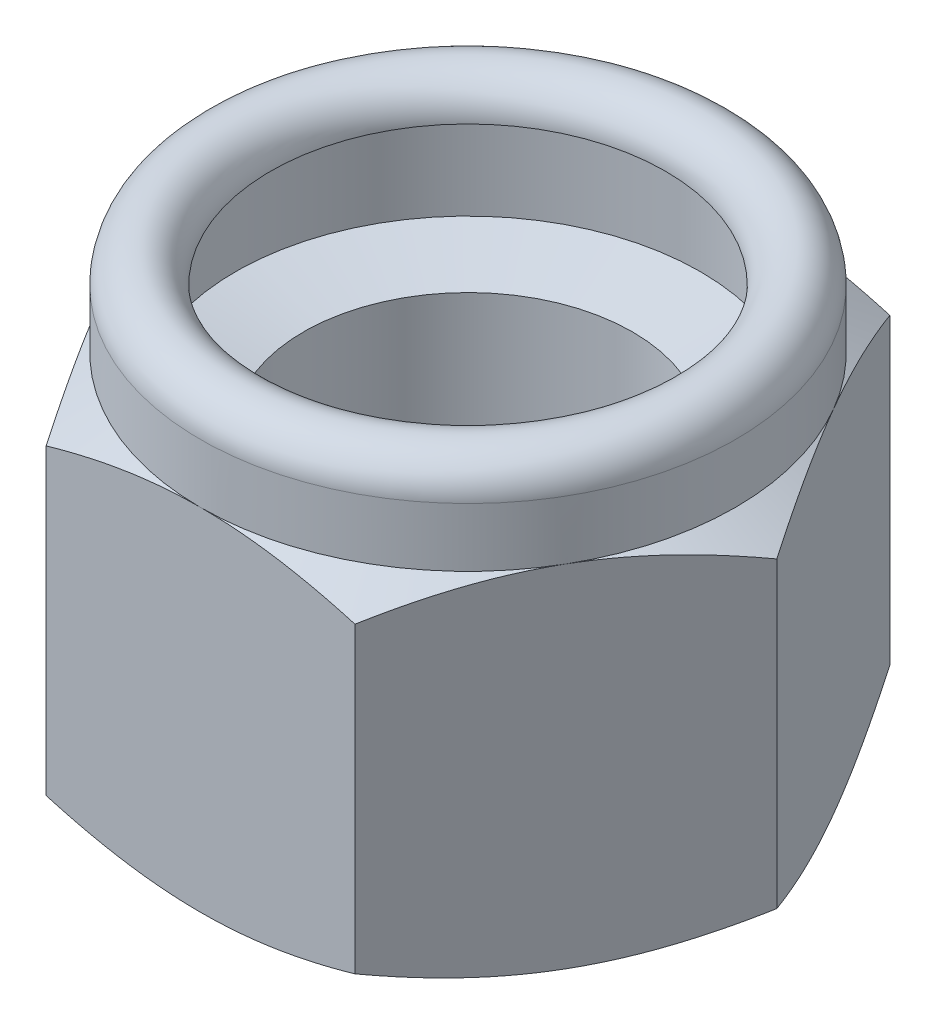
ISO-10303-21;
HEADER;
FILE_DESCRIPTION(('STEP AP214'),'2;1');
FILE_NAME('part.step','',(''),(''),'','','');
FILE_SCHEMA(('AUTOMOTIVE_DESIGN { 1 0 10303 214 1 1 1 1 }'));
ENDSEC;
DATA;
#1=APPLICATION_CONTEXT('core data for automotive mechanical design processes');
#2=APPLICATION_PROTOCOL_DEFINITION('international standard','automotive_design',2000,#1);
#3=PRODUCT_CONTEXT('',#1,'mechanical');
#4=PRODUCT('Part','Part','',(#3));
#5=PRODUCT_RELATED_PRODUCT_CATEGORY('part','',(#4));
#6=PRODUCT_DEFINITION_FORMATION('','',#4);
#7=PRODUCT_DEFINITION_CONTEXT('part definition',#1,'design');
#8=PRODUCT_DEFINITION('design','',#6,#7);
#9=PRODUCT_DEFINITION_SHAPE('','',#8);
#10=(LENGTH_UNIT() NAMED_UNIT(*) SI_UNIT(.MILLI.,.METRE.));
#11=(NAMED_UNIT(*) PLANE_ANGLE_UNIT() SI_UNIT($,.RADIAN.));
#12=(NAMED_UNIT(*) SI_UNIT($,.STERADIAN.) SOLID_ANGLE_UNIT());
#13=UNCERTAINTY_MEASURE_WITH_UNIT(LENGTH_MEASURE(1.E-05),#10,'distance_accuracy_value','');
#14=(GEOMETRIC_REPRESENTATION_CONTEXT(3) GLOBAL_UNCERTAINTY_ASSIGNED_CONTEXT((#13)) GLOBAL_UNIT_ASSIGNED_CONTEXT((#10,
#11,#12)) REPRESENTATION_CONTEXT('',''));
#15=CARTESIAN_POINT('',(0.,0.,0.));
#16=DIRECTION('',(0.,0.,1.));
#17=DIRECTION('',(1.,0.,0.));
#18=AXIS2_PLACEMENT_3D('',#15,#16,#17);
#19=CARTESIAN_POINT('',(0.,0.,0.));
#20=DIRECTION('',(0.,1.,0.));
#21=DIRECTION('',(0.,0.,1.));
#22=AXIS2_PLACEMENT_3D('',#19,#20,#21);
#23=CONICAL_SURFACE('',#22,6.5,1.04719754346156);
#24=CARTESIAN_POINT('',(7.50566896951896,0.580623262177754,0.000200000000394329));
#25=CARTESIAN_POINT('',(7.42317862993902,0.533004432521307,-0.142677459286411));
#26=CARTESIAN_POINT('',(7.34038072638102,0.487546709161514,-0.286087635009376));
#27=CARTESIAN_POINT('',(7.1741125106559,0.401548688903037,-0.57407263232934));
#28=CARTESIAN_POINT('',(7.09064192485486,0.361010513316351,-0.718647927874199));
#29=CARTESIAN_POINT('',(6.8388936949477,0.247571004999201,-1.15468865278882));
#30=CARTESIAN_POINT('',(6.6696223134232,0.183047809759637,-1.4478752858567));
#31=CARTESIAN_POINT('',(6.41631076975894,0.107386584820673,-1.88662374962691));
#32=CARTESIAN_POINT('',(6.33302747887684,0.0858328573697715,-2.03087464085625));
#33=CARTESIAN_POINT('',(6.16608458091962,0.0496903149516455,-2.32002822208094));
#34=CARTESIAN_POINT('',(6.08242500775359,0.0351008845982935,-2.46493085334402));
#35=CARTESIAN_POINT('',(5.91496056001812,0.0132587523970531,-2.75498778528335));
#36=CARTESIAN_POINT('',(5.83115595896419,0.0059977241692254,-2.90014161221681));
#37=CARTESIAN_POINT('',(5.66347396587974,-0.00103969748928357,-3.19057534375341));
#38=CARTESIAN_POINT('',(5.57959657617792,-0.000816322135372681,-3.33585524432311));
#39=CARTESIAN_POINT('',(5.34979921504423,0.0100834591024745,-3.73387594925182));
#40=CARTESIAN_POINT('',(5.20395446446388,0.0283818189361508,-3.98648646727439));
#41=CARTESIAN_POINT('',(4.91323365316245,0.0864063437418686,-4.49002968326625));
#42=CARTESIAN_POINT('',(4.76835861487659,0.126152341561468,-4.74096061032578));
#43=CARTESIAN_POINT('',(4.47705271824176,0.225505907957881,-5.2455172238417));
#44=CARTESIAN_POINT('',(4.33065861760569,0.285534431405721,-5.49907924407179));
#45=CARTESIAN_POINT('',(4.04005357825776,0.421775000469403,-6.00242193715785));
#46=CARTESIAN_POINT('',(3.89583891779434,0.497955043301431,-6.25220905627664));
#47=CARTESIAN_POINT('',(3.75266127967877,0.580623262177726,-6.50020000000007));
#48=B_SPLINE_CURVE_WITH_KNOTS('',3,(#24,#25,#26,#27,#28,#29,#30,#31,#32,#33,#34,#35,#36,#37,#38,
#39,#40,#41,#42,#43,#44,#45,#46,#47),.UNSPECIFIED.,.F.,.F.,(4,2,2,2,2,2,2,2,2,2,2,4),(0.,
0.515105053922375,1.03043143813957,2.06322555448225,2.5669739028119,3.07067773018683,
3.57380861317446,4.07692395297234,4.9527935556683,5.82947447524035,6.72559912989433,
7.61996451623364),.UNSPECIFIED.);
#49=CARTESIAN_POINT('',(7.50555349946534,0.580556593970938,0.));
#50=VERTEX_POINT('',#49);
#51=CARTESIAN_POINT('',(5.62916512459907,0.,-3.24999999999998));
#52=VERTEX_POINT('',#51);
#53=EDGE_CURVE('E235',#50,#52,#48,.T.);
#54=ORIENTED_EDGE('',*,*,#53,.F.);
#55=CARTESIAN_POINT('',(3.75266127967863,0.580623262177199,6.50019999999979));
#56=CARTESIAN_POINT('',(3.83515161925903,0.533004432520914,6.35732254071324));
#57=CARTESIAN_POINT('',(3.91794952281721,0.487546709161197,6.21391236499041));
#58=CARTESIAN_POINT('',(4.08421773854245,0.401548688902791,5.92592736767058));
#59=CARTESIAN_POINT('',(4.16768832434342,0.3610105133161,5.78135207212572));
#60=CARTESIAN_POINT('',(4.41943655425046,0.24757100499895,5.34531134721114));
#61=CARTESIAN_POINT('',(4.58870793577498,0.183047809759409,5.05212471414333));
#62=CARTESIAN_POINT('',(4.8420194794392,0.107386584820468,4.6133762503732));
#63=CARTESIAN_POINT('',(4.92530277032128,0.0858328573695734,4.46912535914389));
#64=CARTESIAN_POINT('',(5.09224566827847,0.0496903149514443,4.17997177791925));
#65=CARTESIAN_POINT('',(5.17590524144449,0.0351008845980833,4.03506914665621));
#66=CARTESIAN_POINT('',(5.34336968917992,0.0132587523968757,3.74501221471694));
#67=CARTESIAN_POINT('',(5.42717429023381,0.00599772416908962,3.59985838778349));
#68=CARTESIAN_POINT('',(5.59485628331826,-0.00103969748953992,3.30942465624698));
#69=CARTESIAN_POINT('',(5.67873367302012,-0.000816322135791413,3.16414475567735));
#70=CARTESIAN_POINT('',(5.90853103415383,0.0100834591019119,2.7661240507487));
#71=CARTESIAN_POINT('',(6.05437578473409,0.0283818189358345,2.51351353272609));
#72=CARTESIAN_POINT('',(6.34509659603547,0.0864063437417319,2.00997031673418));
#73=CARTESIAN_POINT('',(6.48997163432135,0.126152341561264,1.75903938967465));
#74=CARTESIAN_POINT('',(6.78127753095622,0.225505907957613,1.25448277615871));
#75=CARTESIAN_POINT('',(6.92767163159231,0.285534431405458,1.0009207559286));
#76=CARTESIAN_POINT('',(7.21827667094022,0.421775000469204,0.497578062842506));
#77=CARTESIAN_POINT('',(7.36249133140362,0.497955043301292,0.247790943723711));
#78=CARTESIAN_POINT('',(7.50566896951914,0.580623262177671,-0.000199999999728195));
#79=B_SPLINE_CURVE_WITH_KNOTS('',3,(#55,#56,#57,#58,#59,#60,#61,#62,#63,#64,#65,#66,#67,#68,#69,
#70,#71,#72,#73,#74,#75,#76,#77,#78),.UNSPECIFIED.,.F.,.F.,(4,2,2,2,2,2,2,2,2,2,2,4),(0.,
0.515105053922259,1.03043143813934,2.06322555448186,2.56697390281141,3.07067773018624,
3.57380861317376,4.07692395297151,4.95279355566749,5.82947447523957,6.72559912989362,
7.61996451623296),.UNSPECIFIED.);
#80=CARTESIAN_POINT('',(5.62916512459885,-1.38777878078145E-13,3.24999999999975));
#81=VERTEX_POINT('',#80);
#82=EDGE_CURVE('E148',#81,#50,#79,.T.);
#83=ORIENTED_EDGE('',*,*,#82,.F.);
#84=CARTESIAN_POINT('',(0.,0.,0.));
#85=DIRECTION('',(0.,-1.,0.));
#86=DIRECTION('',(0.,0.,-1.));
#87=AXIS2_PLACEMENT_3D('',#84,#85,#86);
#88=CIRCLE('',#87,6.5);
#89=EDGE_CURVE('E257',#52,#81,#88,.T.);
#90=ORIENTED_EDGE('',*,*,#89,.F.);
#91=EDGE_LOOP('',(#54,#83,#90));
#92=FACE_BOUND('',#91,.T.);
#93=ADVANCED_FACE('F30',(#92),#23,.T.);
#94=CARTESIAN_POINT('',(3.75277674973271,0.580556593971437,-6.50000000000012));
#95=VERTEX_POINT('',#94);
#96=EDGE_CURVE('E230',#52,#95,#48,.T.);
#97=ORIENTED_EDGE('',*,*,#96,.F.);
#98=CARTESIAN_POINT('',(2.77555756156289E-13,0.,-6.50000000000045));
#99=VERTEX_POINT('',#98);
#100=EDGE_CURVE('E255',#99,#52,#88,.T.);
#101=ORIENTED_EDGE('',*,*,#100,.F.);
#102=CARTESIAN_POINT('',(-10.0886341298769,3.17616114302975,-6.50000000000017));
#103=CARTESIAN_POINT('',(-9.80467347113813,3.03838174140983,-6.5000000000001));
#104=CARTESIAN_POINT('',(-9.52006185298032,2.90192102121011,-6.50000000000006));
#105=CARTESIAN_POINT('',(-8.94919057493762,2.63237840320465,-6.50000000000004));
#106=CARTESIAN_POINT('',(-8.66293066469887,2.49929703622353,-6.50000000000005));
#107=CARTESIAN_POINT('',(-8.08694567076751,2.23658679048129,-6.50000000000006));
#108=CARTESIAN_POINT('',(-7.79721021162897,2.10698058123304,-6.50000000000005));
#109=CARTESIAN_POINT('',(-7.21543776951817,1.85306089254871,-6.50000000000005));
#110=CARTESIAN_POINT('',(-6.92340089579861,1.72874716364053,-6.50000000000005));
#111=CARTESIAN_POINT('',(-6.32709030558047,1.48290474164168,-6.50000000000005));
#112=CARTESIAN_POINT('',(-6.02272573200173,1.36159523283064,-6.50000000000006));
#113=CARTESIAN_POINT('',(-5.41043841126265,1.1281375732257,-6.50000000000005));
#114=CARTESIAN_POINT('',(-5.10251526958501,1.01599044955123,-6.50000000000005));
#115=CARTESIAN_POINT('',(-4.48319586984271,0.803795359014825,-6.50000000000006));
#116=CARTESIAN_POINT('',(-4.17180806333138,0.70372296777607,-6.50000000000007));
#117=CARTESIAN_POINT('',(-3.54456226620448,0.518884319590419,-6.50000000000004));
#118=CARTESIAN_POINT('',(-3.2287057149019,0.434113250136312,-6.50000000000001));
#119=CARTESIAN_POINT('',(-2.59412088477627,0.284389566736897,-6.50000000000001));
#120=CARTESIAN_POINT('',(-2.27541854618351,0.219328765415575,-6.50000000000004));
#121=CARTESIAN_POINT('',(-1.63399658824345,0.112709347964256,-6.50000000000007));
#122=CARTESIAN_POINT('',(-1.31127735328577,0.0711485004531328,-6.50000000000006));
#123=CARTESIAN_POINT('',(-0.827615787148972,0.0291913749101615,-6.50000000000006));
#124=CARTESIAN_POINT('',(-0.667517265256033,0.0186073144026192,-6.50000000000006));
#125=CARTESIAN_POINT('',(-0.347008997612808,0.00421359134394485,-6.50000000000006));
#126=CARTESIAN_POINT('',(-0.186599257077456,0.000403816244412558,-6.50000000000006));
#127=CARTESIAN_POINT('',(0.134235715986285,-0.000342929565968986,-6.50000000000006));
#128=CARTESIAN_POINT('',(0.294660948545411,0.00272011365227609,-6.50000000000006));
#129=CARTESIAN_POINT('',(0.615239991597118,0.0156420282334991,-6.50000000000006));
#130=CARTESIAN_POINT('',(0.775393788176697,0.0255012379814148,-6.50000000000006));
#131=CARTESIAN_POINT('',(1.16005135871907,0.0571346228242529,-6.50000000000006));
#132=CARTESIAN_POINT('',(1.384296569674,0.0821202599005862,-6.50000000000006));
#133=CARTESIAN_POINT('',(1.83111748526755,0.144054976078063,-6.50000000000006));
#134=CARTESIAN_POINT('',(2.0536929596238,0.181005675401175,-6.50000000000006));
#135=CARTESIAN_POINT('',(2.71866392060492,0.307845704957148,-6.50000000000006));
#136=CARTESIAN_POINT('',(3.15805420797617,0.413699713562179,-6.50000000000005));
#137=CARTESIAN_POINT('',(3.81504917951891,0.597194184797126,-6.50000000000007));
#138=CARTESIAN_POINT('',(4.03606361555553,0.663327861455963,-6.50000000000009));
#139=CARTESIAN_POINT('',(4.47594587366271,0.802449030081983,-6.50000000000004));
#140=CARTESIAN_POINT('',(4.69481368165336,0.875436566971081,-6.49999999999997));
#141=CARTESIAN_POINT('',(5.13047157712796,1.0270956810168,-6.50000000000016));
#142=CARTESIAN_POINT('',(5.34726232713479,1.10576537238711,-6.50000000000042));
#143=CARTESIAN_POINT('',(5.77904891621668,1.26786470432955,-6.49999999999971));
#144=CARTESIAN_POINT('',(5.99404477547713,1.35129429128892,-6.49999999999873));
#145=CARTESIAN_POINT('',(6.49787787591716,1.55220480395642,-6.49999999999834));
#146=CARTESIAN_POINT('',(6.78605773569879,1.6713311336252,-6.4999999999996));
#147=CARTESIAN_POINT('',(7.35998859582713,1.91531429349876,-6.50000000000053));
#148=CARTESIAN_POINT('',(7.64573945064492,2.040171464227,-6.50000000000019));
#149=CARTESIAN_POINT('',(8.21525357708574,2.29447640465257,-6.49999999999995));
#150=CARTESIAN_POINT('',(8.49901644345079,2.42392507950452,-6.50000000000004));
#151=CARTESIAN_POINT('',(9.06483728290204,2.68650288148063,-6.5000000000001));
#152=CARTESIAN_POINT('',(9.34689521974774,2.81963208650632,-6.50000000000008));
#153=CARTESIAN_POINT('',(9.90987348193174,3.08902515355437,-6.50000000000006));
#154=CARTESIAN_POINT('',(10.1907922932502,3.22529217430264,-6.50000000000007));
#155=CARTESIAN_POINT('',(10.7514192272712,3.50029662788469,-6.50000000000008));
#156=CARTESIAN_POINT('',(11.0311273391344,3.63903408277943,-6.50000000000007));
#157=CARTESIAN_POINT('',(11.8686492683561,4.05826371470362,-6.50000000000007));
#158=CARTESIAN_POINT('',(12.4249347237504,4.3418088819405,-6.50000000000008));
#159=CARTESIAN_POINT('',(13.4885089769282,4.89087824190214,-6.50000000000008));
#160=CARTESIAN_POINT('',(13.9960343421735,5.15594623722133,-6.50000000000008));
#161=CARTESIAN_POINT('',(15.0091848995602,5.6897287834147,-6.50000000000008));
#162=CARTESIAN_POINT('',(15.5148100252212,5.95844346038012,-6.50000000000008));
#163=CARTESIAN_POINT('',(16.5233283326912,6.49798637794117,-6.50000000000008));
#164=CARTESIAN_POINT('',(17.0262251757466,6.76880778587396,-6.50000000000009));
#165=CARTESIAN_POINT('',(18.0308016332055,7.31263450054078,-6.50000000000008));
#166=CARTESIAN_POINT('',(18.5324813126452,7.5856396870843,-6.50000000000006));
#167=CARTESIAN_POINT('',(19.0337120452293,7.85946110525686,-6.50000000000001));
#168=B_SPLINE_CURVE_WITH_KNOTS('',3,(#102,#103,#104,#105,#106,#107,#108,#109,#110,#111,#112,
#113,#114,#115,#116,#117,#118,#119,#120,#121,#122,#123,#124,#125,#126,#127,#128,#129,#130,#131,
#132,#133,#134,#135,#136,#137,#138,#139,#140,#141,#142,#143,#144,#145,#146,#147,#148,#149,#150,
#151,#152,#153,#154,#155,#156,#157,#158,#159,#160,#161,#162,#163,#164,#165,#166,#167),
.UNSPECIFIED.,.F.,.F.,(4,2,2,2,2,2,2,2,2,2,2,2,2,2,2,2,2,2,2,2,2,2,2,2,2,2,2,2,2,2,2,2,4),(0.,
0.946875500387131,1.8938988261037,2.84606421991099,3.79818468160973,4.78101744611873,
5.76396023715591,6.74488019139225,7.72549109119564,8.70061771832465,9.67565173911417,
10.1568741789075,10.6380886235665,11.1193040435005,11.6005434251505,12.2770600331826,
12.9536682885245,14.3076338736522,14.9996668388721,15.6917043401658,16.3835132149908,
17.0753142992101,18.0107248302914,18.9461910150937,19.8818426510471,20.8175141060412,
21.7541726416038,22.6908395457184,24.5639267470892,26.2816383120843,27.9994094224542,
29.7129512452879,31.4263993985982),.UNSPECIFIED.);
#169=EDGE_CURVE('E291',#95,#99,#168,.F.);
#170=ORIENTED_EDGE('',*,*,#169,.F.);
#171=EDGE_LOOP('',(#97,#101,#170));
#172=FACE_BOUND('',#171,.T.);
#173=ADVANCED_FACE('F274',(#172),#23,.T.);
#174=CARTESIAN_POINT('',(-3.75277674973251,0.580556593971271,-6.49999999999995));
#175=VERTEX_POINT('',#174);
#176=EDGE_CURVE('E205',#99,#175,#168,.F.);
#177=ORIENTED_EDGE('',*,*,#176,.F.);
#178=CARTESIAN_POINT('',(-5.62916512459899,-4.44089209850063E-13,-3.25000000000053));
#179=VERTEX_POINT('',#178);
#180=EDGE_CURVE('E253',#179,#99,#88,.T.);
#181=ORIENTED_EDGE('',*,*,#180,.F.);
#182=CARTESIAN_POINT('',(-3.75266127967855,0.580623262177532,-6.50020000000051));
#183=CARTESIAN_POINT('',(-3.83515161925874,0.533004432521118,-6.35732254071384));
#184=CARTESIAN_POINT('',(-3.91794952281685,0.487546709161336,-6.21391236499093));
#185=CARTESIAN_POINT('',(-4.08421773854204,0.40154868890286,-5.925927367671));
#186=CARTESIAN_POINT('',(-4.16768832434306,0.361010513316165,-5.78135207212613));
#187=CARTESIAN_POINT('',(-4.41943655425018,0.247571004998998,-5.34531134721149));
#188=CARTESIAN_POINT('',(-4.58870793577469,0.183047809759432,-5.05212471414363));
#189=CARTESIAN_POINT('',(-4.84201947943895,0.107386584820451,-4.61337625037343));
#190=CARTESIAN_POINT('',(-4.92530277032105,0.0858328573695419,-4.4691253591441));
#191=CARTESIAN_POINT('',(-5.09224566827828,0.0496903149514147,-4.1799717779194));
#192=CARTESIAN_POINT('',(-5.17590524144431,0.0351008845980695,-4.03506914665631));
#193=CARTESIAN_POINT('',(-5.34336968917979,0.0132587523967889,-3.74501221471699));
#194=CARTESIAN_POINT('',(-5.42717429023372,0.00599772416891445,-3.59985838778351));
#195=CARTESIAN_POINT('',(-5.59485628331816,-0.00103969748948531,-3.3094246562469));
#196=CARTESIAN_POINT('',(-5.67873367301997,-0.000816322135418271,-3.16414475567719));
#197=CARTESIAN_POINT('',(-5.90853103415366,0.0100834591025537,-2.76612405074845));
#198=CARTESIAN_POINT('',(-6.05437578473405,0.0283818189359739,-2.51351353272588));
#199=CARTESIAN_POINT('',(-6.34509659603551,0.0864063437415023,-2.009970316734));
#200=CARTESIAN_POINT('',(-6.48997163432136,0.126152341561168,-1.75903938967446));
#201=CARTESIAN_POINT('',(-6.78127753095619,0.225505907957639,-1.25448277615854));
#202=CARTESIAN_POINT('',(-6.92767163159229,0.285534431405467,-1.00092075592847));
#203=CARTESIAN_POINT('',(-7.21827667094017,0.421775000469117,-0.497578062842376));
#204=CARTESIAN_POINT('',(-7.36249133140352,0.497955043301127,-0.247790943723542));
#205=CARTESIAN_POINT('',(-7.5056689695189,0.580623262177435,0.000200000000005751));
#206=B_SPLINE_CURVE_WITH_KNOTS('',3,(#182,#183,#184,#185,#186,#187,#188,#189,#190,#191,#192,
#193,#194,#195,#196,#197,#198,#199,#200,#201,#202,#203,#204,#205),.UNSPECIFIED.,.F.,.F.,(4,2,2,
2,2,2,2,2,2,2,2,4),(0.,0.515105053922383,1.03043143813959,2.06322555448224,2.56697390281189,
3.07067773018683,3.57380861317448,4.07692395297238,4.95279355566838,5.82947447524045,
6.72559912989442,7.61996451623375),.UNSPECIFIED.);
#207=EDGE_CURVE('E200',#175,#179,#206,.T.);
#208=ORIENTED_EDGE('',*,*,#207,.F.);
#209=EDGE_LOOP('',(#177,#181,#208));
#210=FACE_BOUND('',#209,.T.);
#211=ADVANCED_FACE('F279',(#210),#23,.T.);
#212=CARTESIAN_POINT('',(-7.50555349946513,0.580556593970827,-1.11022302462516E-13));
#213=VERTEX_POINT('',#212);
#214=EDGE_CURVE('E201',#179,#213,#206,.T.);
#215=ORIENTED_EDGE('',*,*,#214,.F.);
#216=CARTESIAN_POINT('',(-5.62916512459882,2.63677968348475E-13,3.25000000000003));
#217=VERTEX_POINT('',#216);
#218=EDGE_CURVE('E341',#217,#179,#88,.T.);
#219=ORIENTED_EDGE('',*,*,#218,.F.);
#220=CARTESIAN_POINT('',(-7.50566896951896,0.580623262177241,-0.000199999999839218));
#221=CARTESIAN_POINT('',(-7.42317862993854,0.533004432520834,0.142677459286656));
#222=CARTESIAN_POINT('',(-7.34038072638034,0.487546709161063,0.286087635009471));
#223=CARTESIAN_POINT('',(-7.17411251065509,0.401548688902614,0.574072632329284));
#224=CARTESIAN_POINT('',(-7.09064192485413,0.361010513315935,0.718647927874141));
#225=CARTESIAN_POINT('',(-6.83889369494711,0.247571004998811,1.15468865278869));
#226=CARTESIAN_POINT('',(-6.66962231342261,0.18304780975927,1.44787528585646));
#227=CARTESIAN_POINT('',(-6.41631076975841,0.107386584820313,1.88662374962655));
#228=CARTESIAN_POINT('',(-6.33302747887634,0.085832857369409,2.03087464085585));
#229=CARTESIAN_POINT('',(-6.16608458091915,0.0496903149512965,2.32002822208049));
#230=CARTESIAN_POINT('',(-6.08242500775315,0.0351008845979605,2.46493085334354));
#231=CARTESIAN_POINT('',(-5.9149605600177,0.0132587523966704,2.75498778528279));
#232=CARTESIAN_POINT('',(-5.83115595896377,0.00599772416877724,2.90014161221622));
#233=CARTESIAN_POINT('',(-5.6634739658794,-0.00103969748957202,3.1905753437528));
#234=CARTESIAN_POINT('',(-5.57959657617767,-0.000816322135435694,3.3358552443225));
#235=CARTESIAN_POINT('',(-5.34979921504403,0.010083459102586,3.73387594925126));
#236=CARTESIAN_POINT('',(-5.20395446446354,0.0283818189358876,3.9864864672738));
#237=CARTESIAN_POINT('',(-4.913233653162,0.0864063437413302,4.49002968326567));
#238=CARTESIAN_POINT('',(-4.76835861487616,0.126152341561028,4.74096061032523));
#239=CARTESIAN_POINT('',(-4.47705271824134,0.225505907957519,5.24551722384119));
#240=CARTESIAN_POINT('',(-4.33065861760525,0.285534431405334,5.49907924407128));
#241=CARTESIAN_POINT('',(-4.04005357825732,0.421775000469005,6.00242193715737));
#242=CARTESIAN_POINT('',(-3.89583891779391,0.49795504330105,6.25220905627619));
#243=CARTESIAN_POINT('',(-3.75266127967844,0.580623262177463,6.50019999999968));
#244=B_SPLINE_CURVE_WITH_KNOTS('',3,(#220,#221,#222,#223,#224,#225,#226,#227,#228,#229,#230,
#231,#232,#233,#234,#235,#236,#237,#238,#239,#240,#241,#242,#243),.UNSPECIFIED.,.F.,.F.,(4,2,2,
2,2,2,2,2,2,2,2,4),(0.,0.515105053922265,1.03043143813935,2.06322555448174,2.56697390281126,
3.07067773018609,3.57380861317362,4.07692395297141,4.95279355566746,5.82947447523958,
6.72559912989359,7.61996451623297),.UNSPECIFIED.);
#245=EDGE_CURVE('E348',#213,#217,#244,.T.);
#246=ORIENTED_EDGE('',*,*,#245,.F.);
#247=EDGE_LOOP('',(#215,#219,#246));
#248=FACE_BOUND('',#247,.T.);
#249=ADVANCED_FACE('F464',(#248),#23,.T.);
#250=CARTESIAN_POINT('',(-3.75277674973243,0.580556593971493,6.50000000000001));
#251=VERTEX_POINT('',#250);
#252=EDGE_CURVE('E328',#217,#251,#244,.T.);
#253=ORIENTED_EDGE('',*,*,#252,.F.);
#254=CARTESIAN_POINT('',(3.05311331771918E-13,3.60822483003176E-13,6.49999999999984));
#255=VERTEX_POINT('',#254);
#256=EDGE_CURVE('E338',#255,#217,#88,.T.);
#257=ORIENTED_EDGE('',*,*,#256,.F.);
#258=CARTESIAN_POINT('',(-10.088634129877,3.17616114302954,6.49999999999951));
#259=CARTESIAN_POINT('',(-9.80467347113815,3.0383817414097,6.49999999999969));
#260=CARTESIAN_POINT('',(-9.52006185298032,2.90192102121,6.49999999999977));
#261=CARTESIAN_POINT('',(-8.94919057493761,2.63237840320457,6.49999999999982));
#262=CARTESIAN_POINT('',(-8.66293066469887,2.49929703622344,6.4999999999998));
#263=CARTESIAN_POINT('',(-8.08694567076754,2.2365867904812,6.49999999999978));
#264=CARTESIAN_POINT('',(-7.79721021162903,2.10698058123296,6.49999999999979));
#265=CARTESIAN_POINT('',(-7.21543776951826,1.85306089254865,6.49999999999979));
#266=CARTESIAN_POINT('',(-6.92340089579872,1.72874716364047,6.49999999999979));
#267=CARTESIAN_POINT('',(-6.3270903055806,1.48290474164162,6.49999999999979));
#268=CARTESIAN_POINT('',(-6.02272573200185,1.36159523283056,6.49999999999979));
#269=CARTESIAN_POINT('',(-5.41043841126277,1.12813757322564,6.49999999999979));
#270=CARTESIAN_POINT('',(-5.10251526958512,1.01599044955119,6.49999999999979));
#271=CARTESIAN_POINT('',(-4.48319586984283,0.80379535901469,6.49999999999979));
#272=CARTESIAN_POINT('',(-4.17180806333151,0.703722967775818,6.49999999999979));
#273=CARTESIAN_POINT('',(-3.5445622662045,0.518884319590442,6.49999999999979));
#274=CARTESIAN_POINT('',(-3.22870571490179,0.434113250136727,6.49999999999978));
#275=CARTESIAN_POINT('',(-2.59412088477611,0.28438956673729,6.49999999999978));
#276=CARTESIAN_POINT('',(-2.27541854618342,0.219328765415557,6.49999999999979));
#277=CARTESIAN_POINT('',(-1.63399658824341,0.112709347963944,6.49999999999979));
#278=CARTESIAN_POINT('',(-1.3112773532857,0.0711485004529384,6.49999999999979));
#279=CARTESIAN_POINT('',(-0.827615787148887,0.0291913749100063,6.49999999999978));
#280=CARTESIAN_POINT('',(-0.66751726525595,0.0186073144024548,6.49999999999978));
#281=CARTESIAN_POINT('',(-0.34700899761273,0.00421359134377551,6.49999999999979));
#282=CARTESIAN_POINT('',(-0.18659925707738,0.000403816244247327,6.49999999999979));
#283=CARTESIAN_POINT('',(0.13423571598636,-0.000342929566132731,6.49999999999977));
#284=CARTESIAN_POINT('',(0.294660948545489,0.00272011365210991,6.49999999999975));
#285=CARTESIAN_POINT('',(0.615239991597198,0.0156420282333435,6.49999999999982));
#286=CARTESIAN_POINT('',(0.775393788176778,0.0255012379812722,6.49999999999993));
#287=CARTESIAN_POINT('',(1.16005135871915,0.0571346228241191,6.49999999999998));
#288=CARTESIAN_POINT('',(1.38429656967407,0.082120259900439,6.49999999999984));
#289=CARTESIAN_POINT('',(1.83111748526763,0.144054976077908,6.49999999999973));
#290=CARTESIAN_POINT('',(2.05369295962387,0.181005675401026,6.49999999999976));
#291=CARTESIAN_POINT('',(2.71866392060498,0.307845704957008,6.49999999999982));
#292=CARTESIAN_POINT('',(3.15805420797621,0.413699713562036,6.49999999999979));
#293=CARTESIAN_POINT('',(3.81504917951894,0.597194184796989,6.49999999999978));
#294=CARTESIAN_POINT('',(4.03606361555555,0.66332786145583,6.49999999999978));
#295=CARTESIAN_POINT('',(4.47594587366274,0.802449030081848,6.49999999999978));
#296=CARTESIAN_POINT('',(4.69481368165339,0.87543656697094,6.49999999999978));
#297=CARTESIAN_POINT('',(5.13047157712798,1.02709568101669,6.49999999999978));
#298=CARTESIAN_POINT('',(5.34726232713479,1.10576537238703,6.49999999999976));
#299=CARTESIAN_POINT('',(5.77904891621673,1.26786470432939,6.49999999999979));
#300=CARTESIAN_POINT('',(5.99404477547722,1.35129429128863,6.49999999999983));
#301=CARTESIAN_POINT('',(6.49787787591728,1.55220480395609,6.49999999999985));
#302=CARTESIAN_POINT('',(6.78605773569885,1.67133113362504,6.4999999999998));
#303=CARTESIAN_POINT('',(7.35998859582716,1.91531429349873,6.49999999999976));
#304=CARTESIAN_POINT('',(7.64573945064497,2.04017146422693,6.49999999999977));
#305=CARTESIAN_POINT('',(8.21525357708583,2.29447640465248,6.49999999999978));
#306=CARTESIAN_POINT('',(8.49901644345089,2.42392507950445,6.49999999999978));
#307=CARTESIAN_POINT('',(9.06483728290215,2.68650288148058,6.49999999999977));
#308=CARTESIAN_POINT('',(9.34689521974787,2.81963208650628,6.49999999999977));
#309=CARTESIAN_POINT('',(9.90987348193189,3.08902515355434,6.49999999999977));
#310=CARTESIAN_POINT('',(10.1907922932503,3.22529217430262,6.49999999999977));
#311=CARTESIAN_POINT('',(10.7514192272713,3.50029662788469,6.49999999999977));
#312=CARTESIAN_POINT('',(11.0311273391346,3.63903408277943,6.49999999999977));
#313=CARTESIAN_POINT('',(11.8686492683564,4.05826371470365,6.49999999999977));
#314=CARTESIAN_POINT('',(12.4249347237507,4.34180888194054,6.49999999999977));
#315=CARTESIAN_POINT('',(13.4885089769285,4.89087824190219,6.49999999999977));
#316=CARTESIAN_POINT('',(13.9960343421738,5.15594623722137,6.49999999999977));
#317=CARTESIAN_POINT('',(15.0091848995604,5.68972878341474,6.49999999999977));
#318=CARTESIAN_POINT('',(15.5148100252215,5.95844346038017,6.49999999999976));
#319=CARTESIAN_POINT('',(16.5233283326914,6.49798637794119,6.49999999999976));
#320=CARTESIAN_POINT('',(17.0262251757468,6.76880778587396,6.49999999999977));
#321=CARTESIAN_POINT('',(18.0308016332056,7.31263450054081,6.49999999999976));
#322=CARTESIAN_POINT('',(18.5324813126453,7.58563968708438,6.49999999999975));
#323=CARTESIAN_POINT('',(19.0337120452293,7.85946110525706,6.49999999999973));
#324=B_SPLINE_CURVE_WITH_KNOTS('',3,(#258,#259,#260,#261,#262,#263,#264,#265,#266,#267,#268,
#269,#270,#271,#272,#273,#274,#275,#276,#277,#278,#279,#280,#281,#282,#283,#284,#285,#286,#287,
#288,#289,#290,#291,#292,#293,#294,#295,#296,#297,#298,#299,#300,#301,#302,#303,#304,#305,#306,
#307,#308,#309,#310,#311,#312,#313,#314,#315,#316,#317,#318,#319,#320,#321,#322,#323),
.UNSPECIFIED.,.F.,.F.,(4,2,2,2,2,2,2,2,2,2,2,2,2,2,2,2,2,2,2,2,2,2,2,2,2,2,2,2,2,2,2,2,4),(0.,
0.946875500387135,1.89389882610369,2.84606421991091,3.79818468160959,4.78101744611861,
5.76396023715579,6.74488019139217,7.72549109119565,8.7006177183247,9.67565173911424,
10.1568741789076,10.6380886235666,11.1193040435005,11.6005434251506,12.2770600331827,
12.9536682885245,14.3076338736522,14.9996668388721,15.6917043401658,16.3835132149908,
17.0753142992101,18.0107248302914,18.9461910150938,19.8818426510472,20.8175141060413,
21.754172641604,22.6908395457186,24.5639267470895,26.2816383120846,27.9994094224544,
29.7129512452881,31.4263993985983),.UNSPECIFIED.);
#325=EDGE_CURVE('E140',#251,#255,#324,.T.);
#326=ORIENTED_EDGE('',*,*,#325,.F.);
#327=EDGE_LOOP('',(#253,#257,#326));
#328=FACE_BOUND('',#327,.T.);
#329=ADVANCED_FACE('F272',(#328),#23,.T.);
#330=CARTESIAN_POINT('',(2.22044604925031E-13,6.96774193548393,-2.77555756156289E-13));
#331=DIRECTION('',(0.,-1.,0.));
#332=DIRECTION('',(0.,0.,-1.));
#333=AXIS2_PLACEMENT_3D('',#330,#331,#332);
#334=CONICAL_SURFACE('',#333,9.19238815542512,1.04719755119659);
#335=CARTESIAN_POINT('',(-7.50566896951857,7.94156970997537,0.00020000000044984));
#336=CARTESIAN_POINT('',(-7.42317863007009,7.98918853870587,-0.142677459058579));
#337=CARTESIAN_POINT('',(-7.34038072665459,8.03464626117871,-0.286087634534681));
#338=CARTESIAN_POINT('',(-7.17411251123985,8.12064427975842,-0.574072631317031));
#339=CARTESIAN_POINT('',(-7.0906419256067,8.16118245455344,-0.718647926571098));
#340=CARTESIAN_POINT('',(-6.83889369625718,8.27462196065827,-1.15468865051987));
#341=CARTESIAN_POINT('',(-6.66962231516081,8.33914515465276,-1.44787528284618));
#342=CARTESIAN_POINT('',(-6.41631077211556,8.41480637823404,-1.88662374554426));
#343=CARTESIAN_POINT('',(-6.33302748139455,8.43636010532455,-2.03087463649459));
#344=CARTESIAN_POINT('',(-6.16608458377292,8.47250264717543,-2.32002821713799));
#345=CARTESIAN_POINT('',(-6.0824250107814,8.48709207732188,-2.4649308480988));
#346=CARTESIAN_POINT('',(-5.91496056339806,8.50893420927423,-2.75498777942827));
#347=CARTESIAN_POINT('',(-5.83115596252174,8.51619523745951,-2.90014160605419));
#348=CARTESIAN_POINT('',(-5.66347396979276,8.52323265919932,-3.19057533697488));
#349=CARTESIAN_POINT('',(-5.57959658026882,8.52300928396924,-3.33585523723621));
#350=CARTESIAN_POINT('',(-5.34979921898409,8.5121095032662,-3.73387594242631));
#351=CARTESIAN_POINT('',(-5.20395446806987,8.49381114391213,-3.98648646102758));
#352=CARTESIAN_POINT('',(-4.91323365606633,8.435786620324,-4.49002967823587));
#353=CARTESIAN_POINT('',(-4.76835861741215,8.39604062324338,-4.74096060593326));
#354=CARTESIAN_POINT('',(-4.47705272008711,8.29668705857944,-5.24551722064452));
#355=CARTESIAN_POINT('',(-4.33065861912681,8.23665853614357,-5.49907924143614));
#356=CARTESIAN_POINT('',(-4.04005357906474,8.10041796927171,-6.00242193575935));
#357=CARTESIAN_POINT('',(-3.89583891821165,8.02423792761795,-6.25220905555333));
#358=CARTESIAN_POINT('',(-3.7526612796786,7.94156970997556,-6.5002000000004));
#359=B_SPLINE_CURVE_WITH_KNOTS('',3,(#335,#336,#337,#338,#339,#340,#341,#342,#343,#344,#345,
#346,#347,#348,#349,#350,#351,#352,#353,#354,#355,#356,#357,#358),.UNSPECIFIED.,.F.,.F.,(4,2,2,
2,2,2,2,2,2,2,2,4),(0.,0.515105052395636,1.03043143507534,2.06322554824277,2.56697389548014,
3.07067772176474,3.57380860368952,4.07692394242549,4.952793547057,5.82947446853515,
6.72559912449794,7.61996451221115),.UNSPECIFIED.);
#360=CARTESIAN_POINT('',(-7.5055534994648,7.94163637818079,-3.33066907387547E-13));
#361=VERTEX_POINT('',#360);
#362=CARTESIAN_POINT('',(-5.62916511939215,8.52219296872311,-3.24999999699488));
#363=VERTEX_POINT('',#362);
#364=EDGE_CURVE('E323',#361,#363,#359,.T.);
#365=ORIENTED_EDGE('',*,*,#364,.F.);
#366=CARTESIAN_POINT('',(-3.75266127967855,7.9415697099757,6.50019999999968));
#367=CARTESIAN_POINT('',(-3.83515161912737,7.98918853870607,6.35732254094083));
#368=CARTESIAN_POINT('',(-3.917949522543,8.03464626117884,6.21391236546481));
#369=CARTESIAN_POINT('',(-4.08421773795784,8.12064427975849,5.92592736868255));
#370=CARTESIAN_POINT('',(-4.16768832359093,8.16118245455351,5.78135207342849));
#371=CARTESIAN_POINT('',(-4.41943655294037,8.27462196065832,5.34531134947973));
#372=CARTESIAN_POINT('',(-4.58870793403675,8.33914515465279,5.05212471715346));
#373=CARTESIAN_POINT('',(-4.842019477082,8.41480637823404,4.61337625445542));
#374=CARTESIAN_POINT('',(-4.925302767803,8.43636010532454,4.46912536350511));
#375=CARTESIAN_POINT('',(-5.0922456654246,8.47250264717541,4.17997178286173));
#376=CARTESIAN_POINT('',(-5.17590523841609,8.48709207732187,4.03506915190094));
#377=CARTESIAN_POINT('',(-5.34336968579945,8.50893420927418,3.74501222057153));
#378=CARTESIAN_POINT('',(-5.42717428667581,8.5161952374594,3.59985839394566));
#379=CARTESIAN_POINT('',(-5.59485627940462,8.52323265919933,3.30942466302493));
#380=CARTESIAN_POINT('',(-5.67873366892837,8.52300928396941,3.16414476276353));
#381=CARTESIAN_POINT('',(-5.90853103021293,8.51210950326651,2.76612405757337));
#382=CARTESIAN_POINT('',(-6.05437578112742,8.49381114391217,2.51351353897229));
#383=CARTESIAN_POINT('',(-6.34509659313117,8.43578662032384,2.00997032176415));
#384=CARTESIAN_POINT('',(-6.48997163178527,8.39604062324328,1.75903939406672));
#385=CARTESIAN_POINT('',(-6.78127752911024,8.29668705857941,1.25448277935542));
#386=CARTESIAN_POINT('',(-6.92767163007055,8.23665853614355,1.0009207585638));
#387=CARTESIAN_POINT('',(-7.21827667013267,8.1004179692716,0.49757806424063));
#388=CARTESIAN_POINT('',(-7.3624913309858,8.02423792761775,0.247790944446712));
#389=CARTESIAN_POINT('',(-7.50566896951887,7.9415697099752,-0.000200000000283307));
#390=B_SPLINE_CURVE_WITH_KNOTS('',3,(#366,#367,#368,#369,#370,#371,#372,#373,#374,#375,#376,
#377,#378,#379,#380,#381,#382,#383,#384,#385,#386,#387,#388,#389),.UNSPECIFIED.,.F.,.F.,(4,2,2,
2,2,2,2,2,2,2,2,4),(0.,0.515105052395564,1.0304314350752,2.06322554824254,2.56697389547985,
3.07067772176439,3.57380860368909,4.07692394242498,4.95279354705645,5.82947446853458,
6.72559912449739,7.61996451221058),.UNSPECIFIED.);
#391=CARTESIAN_POINT('',(-5.62916511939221,8.52219296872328,3.24999999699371));
#392=VERTEX_POINT('',#391);
#393=EDGE_CURVE('E180',#392,#361,#390,.T.);
#394=ORIENTED_EDGE('',*,*,#393,.F.);
#395=CARTESIAN_POINT('',(1.94289029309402E-13,8.52219296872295,-4.9960036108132E-13));
#396=DIRECTION('',(0.,-1.,0.));
#397=DIRECTION('',(0.,0.,-1.));
#398=AXIS2_PLACEMENT_3D('',#395,#396,#397);
#399=CIRCLE('',#398,6.49999998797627);
#400=EDGE_CURVE('E310',#392,#363,#399,.T.);
#401=ORIENTED_EDGE('',*,*,#400,.T.);
#402=EDGE_LOOP('',(#365,#394,#401));
#403=FACE_BOUND('',#402,.T.);
#404=ADVANCED_FACE('F165',(#403),#334,.T.);
#405=CARTESIAN_POINT('',(-3.75277674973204,7.94163637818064,-6.50000000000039));
#406=VERTEX_POINT('',#405);
#407=EDGE_CURVE('E186',#363,#406,#359,.T.);
#408=ORIENTED_EDGE('',*,*,#407,.F.);
#409=CARTESIAN_POINT('',(2.22044604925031E-13,8.52219296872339,-6.49999999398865));
#410=VERTEX_POINT('',#409);
#411=EDGE_CURVE('E249',#363,#410,#399,.T.);
#412=ORIENTED_EDGE('',*,*,#411,.T.);
#413=CARTESIAN_POINT('',(-10.088634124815,5.34603187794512,-6.50000000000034));
#414=CARTESIAN_POINT('',(-9.8046734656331,5.48381127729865,-6.50000000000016));
#415=CARTESIAN_POINT('',(-9.52006184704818,5.62027199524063,-6.50000000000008));
#416=CARTESIAN_POINT('',(-8.94919056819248,5.88981460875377,-6.50000000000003));
#417=CARTESIAN_POINT('',(-8.66293065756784,6.02289597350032,-6.50000000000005));
#418=CARTESIAN_POINT('',(-8.08694566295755,6.28560621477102,-6.50000000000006));
#419=CARTESIAN_POINT('',(-7.79721020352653,6.41521242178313,-6.50000000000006));
#420=CARTESIAN_POINT('',(-7.21543776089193,6.66913210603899,-6.50000000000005));
#421=CARTESIAN_POINT('',(-6.92340088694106,6.79344583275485,-6.50000000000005));
#422=CARTESIAN_POINT('',(-6.32709029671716,7.03928825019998,-6.50000000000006));
#423=CARTESIAN_POINT('',(-6.02272572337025,7.1605977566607,-6.50000000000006));
#424=CARTESIAN_POINT('',(-5.41043840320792,7.39405541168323,-6.50000000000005));
#425=CARTESIAN_POINT('',(-5.10251526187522,7.50620253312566,-6.50000000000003));
#426=CARTESIAN_POINT('',(-4.48319586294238,7.71839761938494,-6.50000000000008));
#427=CARTESIAN_POINT('',(-4.17180805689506,7.81847000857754,-6.50000000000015));
#428=CARTESIAN_POINT('',(-3.54456226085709,8.00330865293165,-6.49999999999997));
#429=CARTESIAN_POINT('',(-3.22870571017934,8.08807972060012,-6.49999999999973));
#430=CARTESIAN_POINT('',(-2.59412088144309,8.23780340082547,-6.49999999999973));
#431=CARTESIAN_POINT('',(-2.27541854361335,8.30286420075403,-6.49999999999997));
#432=CARTESIAN_POINT('',(-1.63399658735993,8.40948361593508,-6.50000000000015));
#433=CARTESIAN_POINT('',(-1.3112773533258,8.45104446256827,-6.50000000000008));
#434=CARTESIAN_POINT('',(-0.827615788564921,8.49300158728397,-6.50000000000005));
#435=CARTESIAN_POINT('',(-0.667517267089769,8.50358564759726,-6.50000000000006));
#436=CARTESIAN_POINT('',(-0.347009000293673,8.51797937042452,-6.50000000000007));
#437=CARTESIAN_POINT('',(-0.186599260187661,8.52178914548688,-6.50000000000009));
#438=CARTESIAN_POINT('',(0.134235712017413,8.52253589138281,-6.50000000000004));
#439=CARTESIAN_POINT('',(0.294660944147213,8.51947284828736,-6.49999999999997));
#440=CARTESIAN_POINT('',(0.615239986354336,8.50655093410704,-6.50000000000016));
#441=CARTESIAN_POINT('',(0.775393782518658,8.49669172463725,-6.5000000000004));
#442=CARTESIAN_POINT('',(1.16005135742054,8.46505834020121,-6.50000000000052));
#443=CARTESIAN_POINT('',(1.384296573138,8.44007270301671,-6.50000000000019));
#444=CARTESIAN_POINT('',(1.83111749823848,8.37813798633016,-6.49999999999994));
#445=CARTESIAN_POINT('',(2.0536929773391,8.34118728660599,-6.50000000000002));
#446=CARTESIAN_POINT('',(2.71866395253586,8.21434725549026,-6.50000000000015));
#447=CARTESIAN_POINT('',(3.15805424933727,8.1084932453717,-6.50000000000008));
#448=CARTESIAN_POINT('',(3.81504923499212,7.9249987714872,-6.50000000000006));
#449=CARTESIAN_POINT('',(4.0360636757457,7.85886509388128,-6.50000000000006));
#450=CARTESIAN_POINT('',(4.47594594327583,7.71974392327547,-6.50000000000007));
#451=CARTESIAN_POINT('',(4.69481375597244,7.64675638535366,-6.50000000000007));
#452=CARTESIAN_POINT('',(5.13047166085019,7.49509726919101,-6.50000000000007));
#453=CARTESIAN_POINT('',(5.34726241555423,7.4164275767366,-6.50000000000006));
#454=CARTESIAN_POINT('',(5.77904901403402,7.25432824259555,-6.50000000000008));
#455=CARTESIAN_POINT('',(5.99404487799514,7.17089865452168,-6.50000000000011));
#456=CARTESIAN_POINT('',(6.49787798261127,6.96998814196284,-6.50000000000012));
#457=CARTESIAN_POINT('',(6.78605784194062,6.85086181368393,-6.50000000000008));
#458=CARTESIAN_POINT('',(7.35998870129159,6.60687865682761,-6.50000000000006));
#459=CARTESIAN_POINT('',(7.64573955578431,6.4820214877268,-6.50000000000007));
#460=CARTESIAN_POINT('',(8.2152536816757,6.22771655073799,-6.50000000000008));
#461=CARTESIAN_POINT('',(8.49901654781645,6.0982678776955,-6.50000000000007));
#462=CARTESIAN_POINT('',(9.06483738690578,5.83569007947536,-6.50000000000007));
#463=CARTESIAN_POINT('',(9.34689532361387,5.70256087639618,-6.50000000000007));
#464=CARTESIAN_POINT('',(9.9098735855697,5.43316781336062,-6.50000000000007));
#465=CARTESIAN_POINT('',(10.1907923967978,5.2969007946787,-6.50000000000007));
#466=CARTESIAN_POINT('',(10.7514193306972,5.02189634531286,-6.50000000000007));
#467=CARTESIAN_POINT('',(11.0311274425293,4.88315889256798,-6.50000000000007));
#468=CARTESIAN_POINT('',(11.8686493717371,4.46392926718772,-6.50000000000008));
#469=CARTESIAN_POINT('',(12.4249348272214,4.18038410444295,-6.50000000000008));
#470=CARTESIAN_POINT('',(13.4885090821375,3.63131475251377,-6.50000000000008));
#471=CARTESIAN_POINT('',(13.996034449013,3.36624676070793,-6.50000000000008));
#472=CARTESIAN_POINT('',(15.0091850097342,2.8324642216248,-6.50000000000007));
#473=CARTESIAN_POINT('',(15.5148101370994,2.5637495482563,-6.50000000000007));
#474=CARTESIAN_POINT('',(16.523328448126,2.02420663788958,-6.50000000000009));
#475=CARTESIAN_POINT('',(17.0262252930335,1.75338523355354,-6.50000000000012));
#476=CARTESIAN_POINT('',(18.0308017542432,1.20955852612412,-6.50000000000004));
#477=CARTESIAN_POINT('',(18.5324814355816,0.936553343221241,-6.49999999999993));
#478=CARTESIAN_POINT('',(19.0337121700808,0.662731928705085,-6.49999999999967));
#479=B_SPLINE_CURVE_WITH_KNOTS('',3,(#413,#414,#415,#416,#417,#418,#419,#420,#421,#422,#423,
#424,#425,#426,#427,#428,#429,#430,#431,#432,#433,#434,#435,#436,#437,#438,#439,#440,#441,#442,
#443,#444,#445,#446,#447,#448,#449,#450,#451,#452,#453,#454,#455,#456,#457,#458,#459,#460,#461,
#462,#463,#464,#465,#466,#467,#468,#469,#470,#471,#472,#473,#474,#475,#476,#477,#478),
.UNSPECIFIED.,.F.,.F.,(4,2,2,2,2,2,2,2,2,2,2,2,2,2,2,2,2,2,2,2,2,2,2,2,2,2,2,2,2,2,2,2,4),(0.,
0.946875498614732,1.89389882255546,2.84606421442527,3.79818467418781,4.78101743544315,
5.76396022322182,6.74488017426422,7.72549107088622,8.70061769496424,9.6756517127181,
10.1568741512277,10.6380885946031,11.1193040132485,11.6005433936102,12.277060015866,
12.953668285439,14.3076338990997,14.9996668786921,15.6917043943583,16.3835132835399,
17.075314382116,18.0107249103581,18.9461910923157,19.8818427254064,20.8175141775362,
21.7541727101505,22.6908396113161,24.5639268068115,26.281638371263,27.9994094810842,
29.712951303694,31.4263994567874),.UNSPECIFIED.);
#480=EDGE_CURVE('E199',#406,#410,#479,.T.);
#481=ORIENTED_EDGE('',*,*,#480,.F.);
#482=EDGE_LOOP('',(#408,#412,#481));
#483=FACE_BOUND('',#482,.T.);
#484=ADVANCED_FACE('F306',(#483),#334,.T.);
#485=CARTESIAN_POINT('',(3.75277674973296,7.94163637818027,-6.50000000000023));
#486=VERTEX_POINT('',#485);
#487=EDGE_CURVE('E193',#410,#486,#479,.T.);
#488=ORIENTED_EDGE('',*,*,#487,.F.);
#489=CARTESIAN_POINT('',(5.62916511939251,8.52219296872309,-3.24999999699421));
#490=VERTEX_POINT('',#489);
#491=EDGE_CURVE('E250',#410,#490,#399,.T.);
#492=ORIENTED_EDGE('',*,*,#491,.T.);
#493=CARTESIAN_POINT('',(3.75266127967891,7.94156970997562,-6.50020000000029));
#494=CARTESIAN_POINT('',(3.83515161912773,7.98918853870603,-6.35732254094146));
#495=CARTESIAN_POINT('',(3.91794952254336,8.03464626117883,-6.21391236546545));
#496=CARTESIAN_POINT('',(4.08421773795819,8.1206442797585,-5.9259273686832));
#497=CARTESIAN_POINT('',(4.16768832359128,8.16118245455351,-5.78135207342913));
#498=CARTESIAN_POINT('',(4.41943655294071,8.27462196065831,-5.34531134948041));
#499=CARTESIAN_POINT('',(4.58870793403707,8.33914515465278,-5.05212471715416));
#500=CARTESIAN_POINT('',(4.84201947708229,8.41480637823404,-4.61337625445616));
#501=CARTESIAN_POINT('',(4.92530276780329,8.43636010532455,-4.46912536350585));
#502=CARTESIAN_POINT('',(5.09224566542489,8.47250264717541,-4.17997178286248));
#503=CARTESIAN_POINT('',(5.1759052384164,8.48709207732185,-4.03506915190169));
#504=CARTESIAN_POINT('',(5.34336968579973,8.50893420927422,-3.74501222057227));
#505=CARTESIAN_POINT('',(5.42717428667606,8.51619523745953,-3.59985839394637));
#506=CARTESIAN_POINT('',(5.59485627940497,8.52323265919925,-3.30942466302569));
#507=CARTESIAN_POINT('',(5.67873366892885,8.52300928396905,-3.16414476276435));
#508=CARTESIAN_POINT('',(5.90853103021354,8.51210950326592,-2.76612405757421));
#509=CARTESIAN_POINT('',(6.05437578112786,8.49381114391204,-2.51351353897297));
#510=CARTESIAN_POINT('',(6.34509659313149,8.43578662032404,-2.00997032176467));
#511=CARTESIAN_POINT('',(6.48997163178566,8.39604062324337,-1.75903939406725));
#512=CARTESIAN_POINT('',(6.78127752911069,8.29668705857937,-1.25448277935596));
#513=CARTESIAN_POINT('',(6.927671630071,8.2366585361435,-1.00092075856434));
#514=CARTESIAN_POINT('',(7.21827667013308,8.10041796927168,-0.497578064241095));
#515=CARTESIAN_POINT('',(7.36249133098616,8.02423792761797,-0.24779094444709));
#516=CARTESIAN_POINT('',(7.50566896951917,7.94156970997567,0.000200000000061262));
#517=B_SPLINE_CURVE_WITH_KNOTS('',3,(#493,#494,#495,#496,#497,#498,#499,#500,#501,#502,#503,
#504,#505,#506,#507,#508,#509,#510,#511,#512,#513,#514,#515,#516),.UNSPECIFIED.,.F.,.F.,(4,2,2,
2,2,2,2,2,2,2,2,4),(0.,0.515105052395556,1.03043143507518,2.06322554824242,2.56697389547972,
3.07067772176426,3.57380860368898,4.07692394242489,4.95279354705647,5.82947446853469,
6.7255991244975,7.61996451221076),.UNSPECIFIED.);
#518=EDGE_CURVE('E236',#486,#490,#517,.T.);
#519=ORIENTED_EDGE('',*,*,#518,.F.);
#520=EDGE_LOOP('',(#488,#492,#519));
#521=FACE_BOUND('',#520,.T.);
#522=ADVANCED_FACE('F303',(#521),#334,.T.);
#523=CARTESIAN_POINT('',(-3.75277674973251,7.94163637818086,6.49999999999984));
#524=VERTEX_POINT('',#523);
#525=EDGE_CURVE('E327',#524,#392,#390,.T.);
#526=ORIENTED_EDGE('',*,*,#525,.F.);
#527=CARTESIAN_POINT('',(-10.0886341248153,5.34603187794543,6.4999999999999));
#528=CARTESIAN_POINT('',(-9.80467346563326,5.48381127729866,6.49999999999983));
#529=CARTESIAN_POINT('',(-9.52006184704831,5.62027199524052,6.4999999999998));
#530=CARTESIAN_POINT('',(-8.9491905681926,5.88981460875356,6.49999999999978));
#531=CARTESIAN_POINT('',(-8.66293065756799,6.02289597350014,6.49999999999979));
#532=CARTESIAN_POINT('',(-8.0869456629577,6.28560621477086,6.49999999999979));
#533=CARTESIAN_POINT('',(-7.79721020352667,6.41521242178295,6.49999999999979));
#534=CARTESIAN_POINT('',(-7.21543776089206,6.66913210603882,6.49999999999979));
#535=CARTESIAN_POINT('',(-6.92340088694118,6.79344583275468,6.49999999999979));
#536=CARTESIAN_POINT('',(-6.32709029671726,7.03928825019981,6.49999999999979));
#537=CARTESIAN_POINT('',(-6.02272572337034,7.16059775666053,6.49999999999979));
#538=CARTESIAN_POINT('',(-5.41043840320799,7.39405541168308,6.49999999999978));
#539=CARTESIAN_POINT('',(-5.10251526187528,7.50620253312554,6.49999999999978));
#540=CARTESIAN_POINT('',(-4.48319586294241,7.71839761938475,6.49999999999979));
#541=CARTESIAN_POINT('',(-4.17180805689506,7.81847000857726,6.49999999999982));
#542=CARTESIAN_POINT('',(-3.54456226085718,8.00330865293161,6.49999999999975));
#543=CARTESIAN_POINT('',(-3.22870571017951,8.0880797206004,6.49999999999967));
#544=CARTESIAN_POINT('',(-2.59412088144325,8.23780340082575,6.49999999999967));
#545=CARTESIAN_POINT('',(-2.2754185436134,8.30286420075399,6.49999999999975));
#546=CARTESIAN_POINT('',(-1.63399658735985,8.40948361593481,6.49999999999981));
#547=CARTESIAN_POINT('',(-1.31127735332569,8.45104446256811,6.49999999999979));
#548=CARTESIAN_POINT('',(-0.827615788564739,8.49300158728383,6.49999999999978));
#549=CARTESIAN_POINT('',(-0.667517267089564,8.50358564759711,6.49999999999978));
#550=CARTESIAN_POINT('',(-0.347009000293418,8.51797937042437,6.49999999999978));
#551=CARTESIAN_POINT('',(-0.18659926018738,8.52178914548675,6.49999999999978));
#552=CARTESIAN_POINT('',(0.134235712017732,8.52253589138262,6.49999999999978));
#553=CARTESIAN_POINT('',(0.294660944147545,8.51947284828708,6.49999999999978));
#554=CARTESIAN_POINT('',(0.61523998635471,8.50655093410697,6.49999999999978));
#555=CARTESIAN_POINT('',(0.775393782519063,8.49669172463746,6.49999999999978));
#556=CARTESIAN_POINT('',(1.16005135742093,8.46505834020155,6.49999999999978));
#557=CARTESIAN_POINT('',(1.38429657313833,8.44007270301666,6.49999999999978));
#558=CARTESIAN_POINT('',(1.83111749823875,8.37813798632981,6.49999999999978));
#559=CARTESIAN_POINT('',(2.05369297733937,8.34118728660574,6.49999999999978));
#560=CARTESIAN_POINT('',(2.71866395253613,8.21434725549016,6.49999999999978));
#561=CARTESIAN_POINT('',(3.15805424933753,8.1084932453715,6.49999999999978));
#562=CARTESIAN_POINT('',(3.81504923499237,7.92499877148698,6.49999999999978));
#563=CARTESIAN_POINT('',(4.03606367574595,7.85886509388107,6.49999999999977));
#564=CARTESIAN_POINT('',(4.47594594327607,7.71974392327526,6.49999999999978));
#565=CARTESIAN_POINT('',(4.69481375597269,7.64675638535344,6.49999999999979));
#566=CARTESIAN_POINT('',(5.13047166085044,7.49509726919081,6.49999999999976));
#567=CARTESIAN_POINT('',(5.34726241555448,7.41642757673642,6.49999999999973));
#568=CARTESIAN_POINT('',(5.77904901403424,7.25432824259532,6.49999999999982));
#569=CARTESIAN_POINT('',(5.99404487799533,7.17089865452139,6.49999999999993));
#570=CARTESIAN_POINT('',(6.49787798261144,6.96998814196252,6.49999999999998));
#571=CARTESIAN_POINT('',(6.78605784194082,6.85086181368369,6.49999999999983));
#572=CARTESIAN_POINT('',(7.35998870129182,6.60687865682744,6.49999999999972));
#573=CARTESIAN_POINT('',(7.64573955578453,6.48202148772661,6.49999999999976));
#574=CARTESIAN_POINT('',(8.21525368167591,6.22771655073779,6.49999999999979));
#575=CARTESIAN_POINT('',(8.49901654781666,6.09826787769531,6.49999999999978));
#576=CARTESIAN_POINT('',(9.06483738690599,5.83569007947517,6.49999999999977));
#577=CARTESIAN_POINT('',(9.34689532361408,5.70256087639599,6.49999999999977));
#578=CARTESIAN_POINT('',(9.90987358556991,5.43316781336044,6.49999999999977));
#579=CARTESIAN_POINT('',(10.190792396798,5.29690079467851,6.49999999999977));
#580=CARTESIAN_POINT('',(10.7514193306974,5.02189634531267,6.49999999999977));
#581=CARTESIAN_POINT('',(11.0311274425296,4.88315889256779,6.49999999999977));
#582=CARTESIAN_POINT('',(11.8686493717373,4.46392926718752,6.49999999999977));
#583=CARTESIAN_POINT('',(12.4249348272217,4.18038410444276,6.49999999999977));
#584=CARTESIAN_POINT('',(13.4885090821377,3.63131475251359,6.49999999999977));
#585=CARTESIAN_POINT('',(13.9960344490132,3.36624676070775,6.49999999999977));
#586=CARTESIAN_POINT('',(15.0091850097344,2.83246422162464,6.49999999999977));
#587=CARTESIAN_POINT('',(15.5148101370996,2.56374954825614,6.49999999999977));
#588=CARTESIAN_POINT('',(16.5233284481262,2.02420663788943,6.49999999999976));
#589=CARTESIAN_POINT('',(17.0262252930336,1.75338523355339,6.49999999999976));
#590=CARTESIAN_POINT('',(18.0308017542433,1.20955852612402,6.49999999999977));
#591=CARTESIAN_POINT('',(18.5324814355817,0.936553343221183,6.49999999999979));
#592=CARTESIAN_POINT('',(19.033712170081,0.662731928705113,6.49999999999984));
#593=B_SPLINE_CURVE_WITH_KNOTS('',3,(#527,#528,#529,#530,#531,#532,#533,#534,#535,#536,#537,
#538,#539,#540,#541,#542,#543,#544,#545,#546,#547,#548,#549,#550,#551,#552,#553,#554,#555,#556,
#557,#558,#559,#560,#561,#562,#563,#564,#565,#566,#567,#568,#569,#570,#571,#572,#573,#574,#575,
#576,#577,#578,#579,#580,#581,#582,#583,#584,#585,#586,#587,#588,#589,#590,#591,#592),
.UNSPECIFIED.,.F.,.F.,(4,2,2,2,2,2,2,2,2,2,2,2,2,2,2,2,2,2,2,2,2,2,2,2,2,2,2,2,2,2,2,2,4),(0.,
0.946875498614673,1.89389882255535,2.8460642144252,3.79818467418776,4.78101743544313,
5.76396022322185,6.74488017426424,7.7254910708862,8.70061769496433,9.67565171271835,
10.156874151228,10.6380885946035,11.1193040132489,11.6005433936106,12.2770600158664,
12.9536682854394,14.3076338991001,14.9996668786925,15.6917043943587,16.3835132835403,
17.0753143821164,18.0107249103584,18.946191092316,19.8818427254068,20.8175141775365,
21.7541727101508,22.6908396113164,24.5639268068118,26.2816383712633,27.9994094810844,
29.7129513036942,31.4263994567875),.UNSPECIFIED.);
#594=CARTESIAN_POINT('',(6.93889390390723E-13,8.5221929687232,6.49999999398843));
#595=VERTEX_POINT('',#594);
#596=EDGE_CURVE('E138',#595,#524,#593,.F.);
#597=ORIENTED_EDGE('',*,*,#596,.F.);
#598=EDGE_CURVE('E316',#595,#392,#399,.T.);
#599=ORIENTED_EDGE('',*,*,#598,.T.);
#600=EDGE_LOOP('',(#526,#597,#599));
#601=FACE_BOUND('',#600,.T.);
#602=ADVANCED_FACE('F434',(#601),#334,.T.);
#603=CARTESIAN_POINT('',(7.50555349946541,7.94163637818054,-1.66533453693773E-13));
#604=VERTEX_POINT('',#603);
#605=EDGE_CURVE('E225',#490,#604,#517,.T.);
#606=ORIENTED_EDGE('',*,*,#605,.F.);
#607=CARTESIAN_POINT('',(5.62916511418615,8.5221929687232,3.24999999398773));
#608=VERTEX_POINT('',#607);
#609=EDGE_CURVE('E254',#490,#608,#399,.T.);
#610=ORIENTED_EDGE('',*,*,#609,.T.);
#611=CARTESIAN_POINT('',(7.50566896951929,7.94156970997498,-0.000200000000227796));
#612=CARTESIAN_POINT('',(7.4231786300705,7.98918853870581,0.142677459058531));
#613=CARTESIAN_POINT('',(7.34038072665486,8.03464626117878,0.286087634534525));
#614=CARTESIAN_POINT('',(7.17411251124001,8.1206442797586,0.574072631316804));
#615=CARTESIAN_POINT('',(7.0906419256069,8.16118245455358,0.718647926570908));
#616=CARTESIAN_POINT('',(6.83889369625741,8.27462196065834,1.15468865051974));
#617=CARTESIAN_POINT('',(6.66962231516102,8.33914515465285,1.44787528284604));
#618=CARTESIAN_POINT('',(6.41631077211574,8.41480637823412,1.88662374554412));
#619=CARTESIAN_POINT('',(6.33302748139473,8.43636010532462,2.03087463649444));
#620=CARTESIAN_POINT('',(6.16608458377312,8.47250264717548,2.32002821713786));
#621=CARTESIAN_POINT('',(6.08242501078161,8.48709207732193,2.46493084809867));
#622=CARTESIAN_POINT('',(5.91496056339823,8.50893420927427,2.75498777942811));
#623=CARTESIAN_POINT('',(5.83115596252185,8.51619523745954,2.90014160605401));
#624=CARTESIAN_POINT('',(5.66347396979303,8.52323265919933,3.19057533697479));
#625=CARTESIAN_POINT('',(5.57959658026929,8.52300928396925,3.33585523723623));
#626=CARTESIAN_POINT('',(5.34979921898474,8.51210950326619,3.73387594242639));
#627=CARTESIAN_POINT('',(5.20395446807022,8.49381114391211,3.98648646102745));
#628=CARTESIAN_POINT('',(4.91323365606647,8.43578662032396,4.49002967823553));
#629=CARTESIAN_POINT('',(4.7683586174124,8.39604062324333,4.74096060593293));
#630=CARTESIAN_POINT('',(4.47705272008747,8.29668705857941,5.24551722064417));
#631=CARTESIAN_POINT('',(4.33065861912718,8.23665853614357,5.49907924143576));
#632=CARTESIAN_POINT('',(4.04005357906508,8.10041796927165,6.00242193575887));
#633=CARTESIAN_POINT('',(3.89583891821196,8.02423792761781,6.25220905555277));
#634=CARTESIAN_POINT('',(3.75266127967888,7.94156970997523,6.50019999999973));
#635=B_SPLINE_CURVE_WITH_KNOTS('',3,(#611,#612,#613,#614,#615,#616,#617,#618,#619,#620,#621,
#622,#623,#624,#625,#626,#627,#628,#629,#630,#631,#632,#633,#634),.UNSPECIFIED.,.F.,.F.,(4,2,2,
2,2,2,2,2,2,2,2,4),(0.,0.515105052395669,1.0304314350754,2.06322554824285,2.56697389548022,
3.07067772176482,3.5738086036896,4.07692394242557,4.95279354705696,5.829474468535,
6.72559912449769,7.61996451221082),.UNSPECIFIED.);
#636=EDGE_CURVE('E52',#604,#608,#635,.T.);
#637=ORIENTED_EDGE('',*,*,#636,.F.);
#638=EDGE_LOOP('',(#606,#610,#637));
#639=FACE_BOUND('',#638,.T.);
#640=ADVANCED_FACE('F166',(#639),#334,.T.);
#641=CARTESIAN_POINT('',(4.44089209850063E-13,7.409858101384,1.66533453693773E-13));
#642=DIRECTION('',(0.,1.,0.));
#643=DIRECTION('',(0.,0.,1.));
#644=AXIS2_PLACEMENT_3D('',#641,#642,#643);
#645=CONICAL_SURFACE('',#644,5.64999999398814,1.30899693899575);
#646=CARTESIAN_POINT('',(2.22044604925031E-13,6.96774193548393,-2.77555756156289E-13));
#647=DIRECTION('',(0.,-1.,0.));
#648=DIRECTION('',(0.,0.,-1.));
#649=AXIS2_PLACEMENT_3D('',#646,#647,#648);
#650=CIRCLE('',#649,4.);
#651=CARTESIAN_POINT('',(2.1779800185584E-13,6.96774193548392,-4.00000000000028));
#652=VERTEX_POINT('',#651);
#653=EDGE_CURVE('E11',#652,#652,#650,.T.);
#654=ORIENTED_EDGE('',*,*,#653,.T.);
#655=EDGE_LOOP('',(#654));
#656=FACE_BOUND('',#655,.T.);
#657=CARTESIAN_POINT('',(4.44089209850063E-13,7.409858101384,1.66533453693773E-13));
#658=DIRECTION('',(0.,-1.,0.));
#659=DIRECTION('',(0.,0.,-1.));
#660=AXIS2_PLACEMENT_3D('',#657,#658,#659);
#661=CIRCLE('',#660,5.64999999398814);
#662=CARTESIAN_POINT('',(4.38090883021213E-13,7.409858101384,-5.64999999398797));
#663=VERTEX_POINT('',#662);
#664=EDGE_CURVE('E237',#663,#663,#661,.T.);
#665=ORIENTED_EDGE('',*,*,#664,.F.);
#666=EDGE_LOOP('',(#665));
#667=FACE_BOUND('',#666,.T.);
#668=ADVANCED_FACE('F32',(#656,#667),#645,.F.);
#669=CARTESIAN_POINT('',(0.,0.,0.));
#670=DIRECTION('',(0.,-1.,0.));
#671=DIRECTION('',(0.,0.,-1.));
#672=AXIS2_PLACEMENT_3D('',#669,#670,#671);
#673=CYLINDRICAL_SURFACE('',#672,4.);
#674=CARTESIAN_POINT('',(0.,0.,0.));
#675=DIRECTION('',(0.,-1.,0.));
#676=DIRECTION('',(0.,0.,-1.));
#677=AXIS2_PLACEMENT_3D('',#674,#675,#676);
#678=CIRCLE('',#677,4.);
#679=CARTESIAN_POINT('',(0.,0.,-4.));
#680=VERTEX_POINT('',#679);
#681=EDGE_CURVE('E38',#680,#680,#678,.T.);
#682=ORIENTED_EDGE('',*,*,#681,.T.);
#683=EDGE_LOOP('',(#682));
#684=FACE_BOUND('',#683,.T.);
#685=ORIENTED_EDGE('',*,*,#653,.F.);
#686=EDGE_LOOP('',(#685));
#687=FACE_BOUND('',#686,.T.);
#688=ADVANCED_FACE('F261',(#684,#687),#673,.F.);
#689=CARTESIAN_POINT('',(4.00000000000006,-1.11022302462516E-13,1.11022302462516E-13));
#690=DIRECTION('',(0.,-1.,0.));
#691=DIRECTION('',(0.,0.,-1.));
#692=AXIS2_PLACEMENT_3D('',#689,#690,#691);
#693=PLANE('',#692);
#694=ORIENTED_EDGE('',*,*,#100,.T.);
#695=ORIENTED_EDGE('',*,*,#89,.T.);
#696=EDGE_CURVE('E336',#81,#255,#88,.T.);
#697=ORIENTED_EDGE('',*,*,#696,.T.);
#698=ORIENTED_EDGE('',*,*,#256,.T.);
#699=ORIENTED_EDGE('',*,*,#218,.T.);
#700=ORIENTED_EDGE('',*,*,#180,.T.);
#701=EDGE_LOOP('',(#694,#695,#697,#698,#699,#700));
#702=FACE_BOUND('',#701,.T.);
#703=ORIENTED_EDGE('',*,*,#681,.F.);
#704=EDGE_LOOP('',(#703));
#705=FACE_BOUND('',#704,.T.);
#706=ADVANCED_FACE('F264',(#702,#705),#693,.T.);
#707=CARTESIAN_POINT('',(3.75277674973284,0.580556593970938,6.49999999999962));
#708=VERTEX_POINT('',#707);
#709=EDGE_CURVE('E132',#255,#708,#324,.T.);
#710=ORIENTED_EDGE('',*,*,#709,.F.);
#711=ORIENTED_EDGE('',*,*,#696,.F.);
#712=EDGE_CURVE('E45',#708,#81,#79,.T.);
#713=ORIENTED_EDGE('',*,*,#712,.F.);
#714=EDGE_LOOP('',(#710,#711,#713));
#715=FACE_BOUND('',#714,.T.);
#716=ADVANCED_FACE('F164',(#715),#23,.T.);
#717=CARTESIAN_POINT('',(3.7527767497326,7.94163637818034,6.49999999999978));
#718=VERTEX_POINT('',#717);
#719=EDGE_CURVE('E129',#718,#595,#593,.F.);
#720=ORIENTED_EDGE('',*,*,#719,.F.);
#721=EDGE_CURVE('E117',#608,#718,#635,.T.);
#722=ORIENTED_EDGE('',*,*,#721,.F.);
#723=EDGE_CURVE('E137',#608,#595,#399,.T.);
#724=ORIENTED_EDGE('',*,*,#723,.T.);
#725=EDGE_LOOP('',(#720,#722,#724));
#726=FACE_BOUND('',#725,.T.);
#727=ADVANCED_FACE('F136',(#726),#334,.T.);
#728=CARTESIAN_POINT('',(0.,0.,0.));
#729=DIRECTION('',(0.,-1.,0.));
#730=DIRECTION('',(0.,0.,-1.));
#731=AXIS2_PLACEMENT_3D('',#728,#729,#730);
#732=CYLINDRICAL_SURFACE('',#731,6.49999998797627);
#733=CARTESIAN_POINT('',(2.77555756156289E-13,9.95000000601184,-4.44089209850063E-13));
#734=DIRECTION('',(0.,-1.,0.));
#735=DIRECTION('',(0.,0.,-1.));
#736=AXIS2_PLACEMENT_3D('',#733,#734,#735);
#737=CIRCLE('',#736,6.49999998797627);
#738=CARTESIAN_POINT('',(2.70655026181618E-13,9.95000000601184,-6.49999998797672));
#739=VERTEX_POINT('',#738);
#740=EDGE_CURVE('E246',#739,#739,#737,.T.);
#741=ORIENTED_EDGE('',*,*,#740,.T.);
#742=EDGE_LOOP('',(#741));
#743=FACE_BOUND('',#742,.T.);
#744=ORIENTED_EDGE('',*,*,#609,.F.);
#745=ORIENTED_EDGE('',*,*,#491,.F.);
#746=ORIENTED_EDGE('',*,*,#411,.F.);
#747=ORIENTED_EDGE('',*,*,#400,.F.);
#748=ORIENTED_EDGE('',*,*,#598,.F.);
#749=ORIENTED_EDGE('',*,*,#723,.F.);
#750=EDGE_LOOP('',(#744,#745,#746,#747,#748,#749));
#751=FACE_BOUND('',#750,.T.);
#752=ADVANCED_FACE('F163',(#743,#751),#732,.T.);
#753=CARTESIAN_POINT('',(2.77555756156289E-13,9.95000000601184,-4.44089209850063E-13));
#754=DIRECTION('',(0.,-1.,0.));
#755=DIRECTION('',(0.,0.,-1.));
#756=AXIS2_PLACEMENT_3D('',#753,#754,#755);
#757=TOROIDAL_SURFACE('',#756,5.64999999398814,0.849999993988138);
#758=CARTESIAN_POINT('',(2.77555756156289E-13,9.95000000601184,-4.44089209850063E-13));
#759=DIRECTION('',(0.,-1.,0.));
#760=DIRECTION('',(0.,0.,-1.));
#761=AXIS2_PLACEMENT_3D('',#758,#759,#760);
#762=CIRCLE('',#761,4.8);
#763=CARTESIAN_POINT('',(2.7245983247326E-13,9.95000000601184,-4.80000000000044));
#764=VERTEX_POINT('',#763);
#765=EDGE_CURVE('E243',#764,#764,#762,.T.);
#766=ORIENTED_EDGE('',*,*,#765,.T.);
#767=EDGE_LOOP('',(#766));
#768=FACE_BOUND('',#767,.T.);
#769=ORIENTED_EDGE('',*,*,#740,.F.);
#770=EDGE_LOOP('',(#769));
#771=FACE_BOUND('',#770,.T.);
#772=ADVANCED_FACE('F388',(#768,#771),#757,.T.);
#773=CARTESIAN_POINT('',(4.80000000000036,9.95000000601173,0.));
#774=DIRECTION('',(0.,-1.,0.));
#775=DIRECTION('',(0.,0.,-1.));
#776=AXIS2_PLACEMENT_3D('',#773,#774,#775);
#777=PLANE('',#776);
#778=CARTESIAN_POINT('',(2.77555756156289E-13,9.95000000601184,-4.44089209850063E-13));
#779=DIRECTION('',(0.,-1.,0.));
#780=DIRECTION('',(0.,0.,-1.));
#781=AXIS2_PLACEMENT_3D('',#778,#779,#780);
#782=CIRCLE('',#781,5.64999999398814);
#783=CARTESIAN_POINT('',(2.71557429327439E-13,9.95000000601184,-5.64999999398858));
#784=VERTEX_POINT('',#783);
#785=EDGE_CURVE('E240',#784,#784,#782,.T.);
#786=ORIENTED_EDGE('',*,*,#785,.T.);
#787=EDGE_LOOP('',(#786));
#788=FACE_BOUND('',#787,.T.);
#789=ORIENTED_EDGE('',*,*,#765,.F.);
#790=EDGE_LOOP('',(#789));
#791=FACE_BOUND('',#790,.T.);
#792=ADVANCED_FACE('F380',(#788,#791),#777,.T.);
#793=CARTESIAN_POINT('',(0.,0.,0.));
#794=DIRECTION('',(0.,-1.,0.));
#795=DIRECTION('',(0.,0.,-1.));
#796=AXIS2_PLACEMENT_3D('',#793,#794,#795);
#797=CYLINDRICAL_SURFACE('',#796,5.64999999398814);
#798=ORIENTED_EDGE('',*,*,#664,.T.);
#799=EDGE_LOOP('',(#798));
#800=FACE_BOUND('',#799,.T.);
#801=ORIENTED_EDGE('',*,*,#785,.F.);
#802=EDGE_LOOP('',(#801));
#803=FACE_BOUND('',#802,.T.);
#804=ADVANCED_FACE('F221',(#800,#803),#797,.F.);
#805=CARTESIAN_POINT('',(3.75277674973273,10.7999999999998,-6.50000000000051));
#806=DIRECTION('',(-0.866025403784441,0.,0.499999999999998));
#807=DIRECTION('',(0.499999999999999,0.,0.86602540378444));
#808=AXIS2_PLACEMENT_3D('',#805,#806,#807);
#809=PLANE('',#808);
#810=ORIENTED_EDGE('',*,*,#53,.T.);
#811=ORIENTED_EDGE('',*,*,#96,.T.);
#812=DIRECTION('',(0.,-1.,0.));
#813=VECTOR('',#812,1.);
#814=CARTESIAN_POINT('',(3.75277674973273,10.7999999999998,-6.50000000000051));
#815=LINE('',#814,#813);
#816=EDGE_CURVE('E125',#486,#95,#815,.T.);
#817=ORIENTED_EDGE('',*,*,#816,.F.);
#818=ORIENTED_EDGE('',*,*,#518,.T.);
#819=ORIENTED_EDGE('',*,*,#605,.T.);
#820=DIRECTION('',(0.,-1.,0.));
#821=VECTOR('',#820,1.);
#822=CARTESIAN_POINT('',(7.50555349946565,10.7999999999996,3.88578058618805E-13));
#823=LINE('',#822,#821);
#824=EDGE_CURVE('E134',#604,#50,#823,.T.);
#825=ORIENTED_EDGE('',*,*,#824,.T.);
#826=EDGE_LOOP('',(#810,#811,#817,#818,#819,#825));
#827=FACE_BOUND('',#826,.T.);
#828=ADVANCED_FACE('F214',(#827),#809,.F.);
#829=CARTESIAN_POINT('',(-3.75277674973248,10.8,-6.50000000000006));
#830=DIRECTION('',(0.,0.,1.));
#831=DIRECTION('',(1.,0.,0.));
#832=AXIS2_PLACEMENT_3D('',#829,#830,#831);
#833=PLANE('',#832);
#834=ORIENTED_EDGE('',*,*,#169,.T.);
#835=ORIENTED_EDGE('',*,*,#176,.T.);
#836=DIRECTION('',(0.,-1.,0.));
#837=VECTOR('',#836,1.);
#838=CARTESIAN_POINT('',(-3.75277674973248,10.8,-6.50000000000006));
#839=LINE('',#838,#837);
#840=EDGE_CURVE('E297',#406,#175,#839,.T.);
#841=ORIENTED_EDGE('',*,*,#840,.F.);
#842=ORIENTED_EDGE('',*,*,#480,.T.);
#843=ORIENTED_EDGE('',*,*,#487,.T.);
#844=ORIENTED_EDGE('',*,*,#816,.T.);
#845=EDGE_LOOP('',(#834,#835,#841,#842,#843,#844));
#846=FACE_BOUND('',#845,.T.);
#847=ADVANCED_FACE('F209',(#846),#833,.F.);
#848=CARTESIAN_POINT('',(-3.75277674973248,10.8,-6.50000000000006));
#849=DIRECTION('',(0.86602540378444,0.,0.499999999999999));
#850=DIRECTION('',(0.499999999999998,0.,-0.866025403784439));
#851=AXIS2_PLACEMENT_3D('',#848,#849,#850);
#852=PLANE('',#851);
#853=ORIENTED_EDGE('',*,*,#207,.T.);
#854=ORIENTED_EDGE('',*,*,#214,.T.);
#855=DIRECTION('',(0.,-1.,0.));
#856=VECTOR('',#855,1.);
#857=CARTESIAN_POINT('',(-7.5055534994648,10.7999999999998,3.88578058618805E-13));
#858=LINE('',#857,#856);
#859=EDGE_CURVE('E491',#361,#213,#858,.T.);
#860=ORIENTED_EDGE('',*,*,#859,.F.);
#861=ORIENTED_EDGE('',*,*,#364,.T.);
#862=ORIENTED_EDGE('',*,*,#407,.T.);
#863=ORIENTED_EDGE('',*,*,#840,.T.);
#864=EDGE_LOOP('',(#853,#854,#860,#861,#862,#863));
#865=FACE_BOUND('',#864,.T.);
#866=ADVANCED_FACE('F213',(#865),#852,.F.);
#867=CARTESIAN_POINT('',(-3.75277674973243,10.8000000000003,6.49999999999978));
#868=DIRECTION('',(0.866025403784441,0.,-0.499999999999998));
#869=DIRECTION('',(-0.499999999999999,0.,-0.86602540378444));
#870=AXIS2_PLACEMENT_3D('',#867,#868,#869);
#871=PLANE('',#870);
#872=ORIENTED_EDGE('',*,*,#245,.T.);
#873=ORIENTED_EDGE('',*,*,#252,.T.);
#874=DIRECTION('',(0.,-1.,0.));
#875=VECTOR('',#874,1.);
#876=CARTESIAN_POINT('',(-3.75277674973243,10.8000000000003,6.49999999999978));
#877=LINE('',#876,#875);
#878=EDGE_CURVE('E133',#524,#251,#877,.T.);
#879=ORIENTED_EDGE('',*,*,#878,.F.);
#880=ORIENTED_EDGE('',*,*,#525,.T.);
#881=ORIENTED_EDGE('',*,*,#393,.T.);
#882=ORIENTED_EDGE('',*,*,#859,.T.);
#883=EDGE_LOOP('',(#872,#873,#879,#880,#881,#882));
#884=FACE_BOUND('',#883,.T.);
#885=ADVANCED_FACE('F353',(#884),#871,.F.);
#886=CARTESIAN_POINT('',(-3.75277674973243,10.8000000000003,6.49999999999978));
#887=DIRECTION('',(0.,0.,-1.));
#888=DIRECTION('',(-1.,0.,0.));
#889=AXIS2_PLACEMENT_3D('',#886,#887,#888);
#890=PLANE('',#889);
#891=ORIENTED_EDGE('',*,*,#325,.T.);
#892=ORIENTED_EDGE('',*,*,#709,.T.);
#893=DIRECTION('',(0.,-1.,0.));
#894=VECTOR('',#893,1.);
#895=CARTESIAN_POINT('',(3.75277674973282,10.7999999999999,6.49999999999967));
#896=LINE('',#895,#894);
#897=EDGE_CURVE('E120',#718,#708,#896,.T.);
#898=ORIENTED_EDGE('',*,*,#897,.F.);
#899=ORIENTED_EDGE('',*,*,#719,.T.);
#900=ORIENTED_EDGE('',*,*,#596,.T.);
#901=ORIENTED_EDGE('',*,*,#878,.T.);
#902=EDGE_LOOP('',(#891,#892,#898,#899,#900,#901));
#903=FACE_BOUND('',#902,.T.);
#904=ADVANCED_FACE('F128',(#903),#890,.F.);
#905=CARTESIAN_POINT('',(3.75277674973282,10.7999999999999,6.49999999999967));
#906=DIRECTION('',(-0.86602540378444,0.,-0.499999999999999));
#907=DIRECTION('',(-0.499999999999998,0.,0.866025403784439));
#908=AXIS2_PLACEMENT_3D('',#905,#906,#907);
#909=PLANE('',#908);
#910=ORIENTED_EDGE('',*,*,#712,.T.);
#911=ORIENTED_EDGE('',*,*,#82,.T.);
#912=ORIENTED_EDGE('',*,*,#824,.F.);
#913=ORIENTED_EDGE('',*,*,#636,.T.);
#914=ORIENTED_EDGE('',*,*,#721,.T.);
#915=ORIENTED_EDGE('',*,*,#897,.T.);
#916=EDGE_LOOP('',(#910,#911,#912,#913,#914,#915));
#917=FACE_BOUND('',#916,.T.);
#918=ADVANCED_FACE('F119',(#917),#909,.F.);
#919=CLOSED_SHELL('',(#93,#173,#211,#249,#329,#404,#484,#522,#602,#640,#668,#688,#706,#716,#727,
#752,#772,#792,#804,#828,#847,#866,#885,#904,#918));
#920=MANIFOLD_SOLID_BREP('B2',#919);
#921=ADVANCED_BREP_SHAPE_REPRESENTATION('',(#18,#920),#14);
#922=SHAPE_DEFINITION_REPRESENTATION(#9,#921);
ENDSEC;
END-ISO-10303-21;
